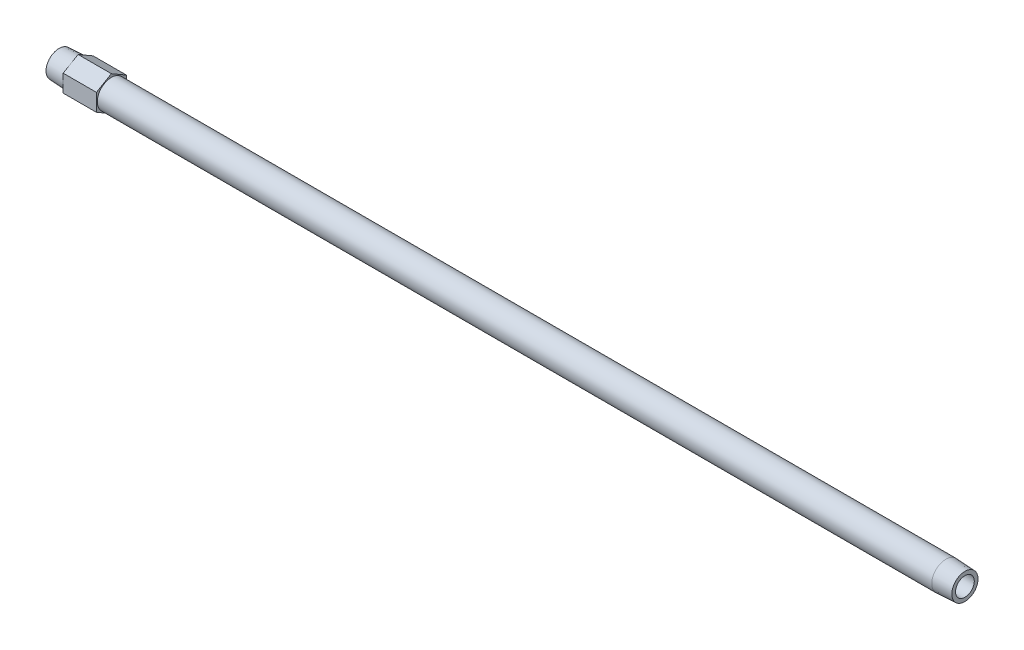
ISO-10303-21;
HEADER;
FILE_DESCRIPTION(('STEP AP214'),'2;1');
FILE_NAME('part.step','',(''),(''),'','','');
FILE_SCHEMA(('AUTOMOTIVE_DESIGN { 1 0 10303 214 1 1 1 1 }'));
ENDSEC;
DATA;
#1=APPLICATION_CONTEXT('core data for automotive mechanical design processes');
#2=APPLICATION_PROTOCOL_DEFINITION('international standard','automotive_design',2000,#1);
#3=PRODUCT_CONTEXT('',#1,'mechanical');
#4=PRODUCT('Part','Part','',(#3));
#5=PRODUCT_RELATED_PRODUCT_CATEGORY('part','',(#4));
#6=PRODUCT_DEFINITION_FORMATION('','',#4);
#7=PRODUCT_DEFINITION_CONTEXT('part definition',#1,'design');
#8=PRODUCT_DEFINITION('design','',#6,#7);
#9=PRODUCT_DEFINITION_SHAPE('','',#8);
#10=(LENGTH_UNIT() NAMED_UNIT(*) SI_UNIT(.MILLI.,.METRE.));
#11=(NAMED_UNIT(*) PLANE_ANGLE_UNIT() SI_UNIT($,.RADIAN.));
#12=(NAMED_UNIT(*) SI_UNIT($,.STERADIAN.) SOLID_ANGLE_UNIT());
#13=UNCERTAINTY_MEASURE_WITH_UNIT(LENGTH_MEASURE(1.E-05),#10,'distance_accuracy_value','');
#14=(GEOMETRIC_REPRESENTATION_CONTEXT(3) GLOBAL_UNCERTAINTY_ASSIGNED_CONTEXT((#13)) GLOBAL_UNIT_ASSIGNED_CONTEXT((#10,
#11,#12)) REPRESENTATION_CONTEXT('',''));
#15=CARTESIAN_POINT('',(0.,0.,0.));
#16=DIRECTION('',(0.,0.,1.));
#17=DIRECTION('',(1.,0.,0.));
#18=AXIS2_PLACEMENT_3D('',#15,#16,#17);
#19=CARTESIAN_POINT('',(0.,0.,-4.78009397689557));
#20=DIRECTION('',(1.,0.,0.));
#21=DIRECTION('',(0.,0.,-1.));
#22=AXIS2_PLACEMENT_3D('',#19,#20,#21);
#23=PLANE('',#22);
#24=CARTESIAN_POINT('',(0.,0.,0.));
#25=DIRECTION('',(-1.,0.,0.));
#26=DIRECTION('',(0.,0.,1.));
#27=AXIS2_PLACEMENT_3D('',#24,#25,#26);
#28=CIRCLE('',#27,4.78009397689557);
#29=CARTESIAN_POINT('',(0.,0.,4.78009397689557));
#30=VERTEX_POINT('',#29);
#31=EDGE_CURVE('E147',#30,#30,#28,.T.);
#32=ORIENTED_EDGE('',*,*,#31,.T.);
#33=EDGE_LOOP('',(#32));
#34=FACE_BOUND('',#33,.T.);
#35=CARTESIAN_POINT('',(0.,0.,0.));
#36=DIRECTION('',(1.,0.,0.));
#37=DIRECTION('',(0.,0.,1.));
#38=AXIS2_PLACEMENT_3D('',#35,#36,#37);
#39=CIRCLE('',#38,3.4163);
#40=CARTESIAN_POINT('',(0.,0.,3.4163));
#41=VERTEX_POINT('',#40);
#42=EDGE_CURVE('E159',#41,#41,#39,.T.);
#43=ORIENTED_EDGE('',*,*,#42,.T.);
#44=EDGE_LOOP('',(#43));
#45=FACE_BOUND('',#44,.T.);
#46=ADVANCED_FACE('F15',(#34,#45),#23,.F.);
#47=CARTESIAN_POINT('',(330.2,0.,-4.78009397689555));
#48=DIRECTION('',(-1.,0.,0.));
#49=DIRECTION('',(0.,0.,1.));
#50=AXIS2_PLACEMENT_3D('',#47,#48,#49);
#51=PLANE('',#50);
#52=CARTESIAN_POINT('',(330.2,0.,0.));
#53=DIRECTION('',(-1.,0.,0.));
#54=DIRECTION('',(0.,0.,1.));
#55=AXIS2_PLACEMENT_3D('',#52,#53,#54);
#56=CIRCLE('',#55,4.78009397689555);
#57=CARTESIAN_POINT('',(330.2,0.,4.78009397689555));
#58=VERTEX_POINT('',#57);
#59=EDGE_CURVE('E150',#58,#58,#56,.T.);
#60=ORIENTED_EDGE('',*,*,#59,.F.);
#61=EDGE_LOOP('',(#60));
#62=FACE_BOUND('',#61,.T.);
#63=CARTESIAN_POINT('',(330.2,0.,0.));
#64=DIRECTION('',(-1.,0.,0.));
#65=DIRECTION('',(0.,0.,1.));
#66=AXIS2_PLACEMENT_3D('',#63,#64,#65);
#67=CIRCLE('',#66,3.4163);
#68=CARTESIAN_POINT('',(330.2,0.,3.4163));
#69=VERTEX_POINT('',#68);
#70=EDGE_CURVE('E156',#69,#69,#67,.F.);
#71=ORIENTED_EDGE('',*,*,#70,.F.);
#72=EDGE_LOOP('',(#71));
#73=FACE_BOUND('',#72,.T.);
#74=ADVANCED_FACE('F178',(#62,#73),#51,.F.);
#75=CARTESIAN_POINT('',(19.05,-9.45872946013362,5.461));
#76=DIRECTION('',(-1.,0.,0.));
#77=DIRECTION('',(0.,-1.,0.));
#78=AXIS2_PLACEMENT_3D('',#75,#76,#77);
#79=PLANE('',#78);
#80=DIRECTION('',(0.,0.5,-0.866025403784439));
#81=VECTOR('',#80,1.);
#82=CARTESIAN_POINT('',(19.05,-6.30581964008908,0.));
#83=LINE('',#82,#81);
#84=CARTESIAN_POINT('',(19.05,-6.30581964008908,0.));
#85=VERTEX_POINT('',#84);
#86=CARTESIAN_POINT('',(19.05,-3.15290982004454,-5.461));
#87=VERTEX_POINT('',#86);
#88=EDGE_CURVE('E103',#85,#87,#83,.T.);
#89=ORIENTED_EDGE('',*,*,#88,.T.);
#90=DIRECTION('',(0.,1.,0.));
#91=VECTOR('',#90,1.);
#92=CARTESIAN_POINT('',(19.05,-3.15290982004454,-5.461));
#93=LINE('',#92,#91);
#94=CARTESIAN_POINT('',(19.05,3.15290982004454,-5.461));
#95=VERTEX_POINT('',#94);
#96=EDGE_CURVE('E83',#87,#95,#93,.T.);
#97=ORIENTED_EDGE('',*,*,#96,.T.);
#98=DIRECTION('',(0.,0.5,0.866025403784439));
#99=VECTOR('',#98,1.);
#100=CARTESIAN_POINT('',(19.05,3.15290982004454,-5.461));
#101=LINE('',#100,#99);
#102=CARTESIAN_POINT('',(19.05,6.30581964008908,0.));
#103=VERTEX_POINT('',#102);
#104=EDGE_CURVE('E102',#95,#103,#101,.T.);
#105=ORIENTED_EDGE('',*,*,#104,.T.);
#106=DIRECTION('',(0.,-0.5,0.866025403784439));
#107=VECTOR('',#106,1.);
#108=CARTESIAN_POINT('',(19.05,6.30581964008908,0.));
#109=LINE('',#108,#107);
#110=CARTESIAN_POINT('',(19.05,3.15290982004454,5.461));
#111=VERTEX_POINT('',#110);
#112=EDGE_CURVE('E105',#103,#111,#109,.T.);
#113=ORIENTED_EDGE('',*,*,#112,.T.);
#114=DIRECTION('',(0.,-1.,0.));
#115=VECTOR('',#114,1.);
#116=CARTESIAN_POINT('',(19.05,3.15290982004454,5.461));
#117=LINE('',#116,#115);
#118=CARTESIAN_POINT('',(19.05,-3.15290982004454,5.461));
#119=VERTEX_POINT('',#118);
#120=EDGE_CURVE('E35',#111,#119,#117,.T.);
#121=ORIENTED_EDGE('',*,*,#120,.T.);
#122=DIRECTION('',(0.,-0.5,-0.866025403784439));
#123=VECTOR('',#122,1.);
#124=CARTESIAN_POINT('',(19.05,-3.15290982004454,5.461));
#125=LINE('',#124,#123);
#126=EDGE_CURVE('E30',#119,#85,#125,.T.);
#127=ORIENTED_EDGE('',*,*,#126,.T.);
#128=EDGE_LOOP('',(#89,#97,#105,#113,#121,#127));
#129=FACE_BOUND('',#128,.T.);
#130=CARTESIAN_POINT('',(19.05,0.,0.));
#131=DIRECTION('',(-1.,0.,0.));
#132=DIRECTION('',(0.,-1.,0.));
#133=AXIS2_PLACEMENT_3D('',#130,#131,#132);
#134=CIRCLE('',#133,5.1435);
#135=CARTESIAN_POINT('',(19.05,-5.1435,0.));
#136=VERTEX_POINT('',#135);
#137=EDGE_CURVE('E89',#136,#136,#134,.F.);
#138=ORIENTED_EDGE('',*,*,#137,.F.);
#139=EDGE_LOOP('',(#138));
#140=FACE_BOUND('',#139,.T.);
#141=ADVANCED_FACE('F124',(#129,#140),#79,.F.);
#142=CARTESIAN_POINT('',(6.9342,-9.45872946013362,5.461));
#143=DIRECTION('',(-1.,0.,0.));
#144=DIRECTION('',(0.,-1.,0.));
#145=AXIS2_PLACEMENT_3D('',#142,#143,#144);
#146=PLANE('',#145);
#147=DIRECTION('',(0.,0.5,-0.866025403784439));
#148=VECTOR('',#147,1.);
#149=CARTESIAN_POINT('',(6.9342,-6.30581964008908,0.));
#150=LINE('',#149,#148);
#151=CARTESIAN_POINT('',(6.9342,-6.30581964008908,0.));
#152=VERTEX_POINT('',#151);
#153=CARTESIAN_POINT('',(6.9342,-3.15290982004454,-5.461));
#154=VERTEX_POINT('',#153);
#155=EDGE_CURVE('E73',#152,#154,#150,.T.);
#156=ORIENTED_EDGE('',*,*,#155,.F.);
#157=DIRECTION('',(0.,-0.5,-0.866025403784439));
#158=VECTOR('',#157,1.);
#159=CARTESIAN_POINT('',(6.9342,-3.15290982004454,5.461));
#160=LINE('',#159,#158);
#161=CARTESIAN_POINT('',(6.9342,-3.15290982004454,5.461));
#162=VERTEX_POINT('',#161);
#163=EDGE_CURVE('E99',#162,#152,#160,.T.);
#164=ORIENTED_EDGE('',*,*,#163,.F.);
#165=DIRECTION('',(0.,-1.,0.));
#166=VECTOR('',#165,1.);
#167=CARTESIAN_POINT('',(6.9342,3.15290982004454,5.461));
#168=LINE('',#167,#166);
#169=CARTESIAN_POINT('',(6.9342,3.15290982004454,5.461));
#170=VERTEX_POINT('',#169);
#171=EDGE_CURVE('E133',#170,#162,#168,.T.);
#172=ORIENTED_EDGE('',*,*,#171,.F.);
#173=DIRECTION('',(0.,-0.5,0.866025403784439));
#174=VECTOR('',#173,1.);
#175=CARTESIAN_POINT('',(6.9342,6.30581964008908,0.));
#176=LINE('',#175,#174);
#177=CARTESIAN_POINT('',(6.9342,6.30581964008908,0.));
#178=VERTEX_POINT('',#177);
#179=EDGE_CURVE('E129',#178,#170,#176,.T.);
#180=ORIENTED_EDGE('',*,*,#179,.F.);
#181=DIRECTION('',(0.,0.5,0.866025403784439));
#182=VECTOR('',#181,1.);
#183=CARTESIAN_POINT('',(6.9342,3.15290982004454,-5.461));
#184=LINE('',#183,#182);
#185=CARTESIAN_POINT('',(6.9342,3.15290982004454,-5.461));
#186=VERTEX_POINT('',#185);
#187=EDGE_CURVE('E75',#186,#178,#184,.T.);
#188=ORIENTED_EDGE('',*,*,#187,.F.);
#189=DIRECTION('',(0.,1.,0.));
#190=VECTOR('',#189,1.);
#191=CARTESIAN_POINT('',(6.9342,-3.15290982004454,-5.461));
#192=LINE('',#191,#190);
#193=EDGE_CURVE('E68',#154,#186,#192,.T.);
#194=ORIENTED_EDGE('',*,*,#193,.F.);
#195=EDGE_LOOP('',(#156,#164,#172,#180,#188,#194));
#196=FACE_BOUND('',#195,.T.);
#197=CARTESIAN_POINT('',(6.9342,0.,0.));
#198=DIRECTION('',(-1.,0.,0.));
#199=DIRECTION('',(0.,0.,1.));
#200=AXIS2_PLACEMENT_3D('',#197,#198,#199);
#201=CIRCLE('',#200,5.1435);
#202=CARTESIAN_POINT('',(6.9342,0.,5.1435));
#203=VERTEX_POINT('',#202);
#204=EDGE_CURVE('E95',#203,#203,#201,.T.);
#205=ORIENTED_EDGE('',*,*,#204,.F.);
#206=EDGE_LOOP('',(#205));
#207=FACE_BOUND('',#206,.T.);
#208=ADVANCED_FACE('F69',(#196,#207),#146,.T.);
#209=CARTESIAN_POINT('',(19.05,-6.30581964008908,0.));
#210=DIRECTION('',(0.,0.866025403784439,0.5));
#211=DIRECTION('',(0.,-0.5,0.866025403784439));
#212=AXIS2_PLACEMENT_3D('',#209,#210,#211);
#213=PLANE('',#212);
#214=ORIENTED_EDGE('',*,*,#155,.T.);
#215=DIRECTION('',(-1.,0.,0.));
#216=VECTOR('',#215,1.);
#217=CARTESIAN_POINT('',(19.05,-3.15290982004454,-5.461));
#218=LINE('',#217,#216);
#219=EDGE_CURVE('E10',#87,#154,#218,.T.);
#220=ORIENTED_EDGE('',*,*,#219,.F.);
#221=ORIENTED_EDGE('',*,*,#88,.F.);
#222=DIRECTION('',(-1.,0.,0.));
#223=VECTOR('',#222,1.);
#224=CARTESIAN_POINT('',(19.05,-6.30581964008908,0.));
#225=LINE('',#224,#223);
#226=EDGE_CURVE('E87',#85,#152,#225,.T.);
#227=ORIENTED_EDGE('',*,*,#226,.T.);
#228=EDGE_LOOP('',(#214,#220,#221,#227));
#229=FACE_BOUND('',#228,.T.);
#230=ADVANCED_FACE('F17',(#229),#213,.F.);
#231=CARTESIAN_POINT('',(19.05,-3.15290982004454,-5.461));
#232=DIRECTION('',(0.,0.,1.));
#233=DIRECTION('',(0.,-1.,0.));
#234=AXIS2_PLACEMENT_3D('',#231,#232,#233);
#235=PLANE('',#234);
#236=ORIENTED_EDGE('',*,*,#193,.T.);
#237=DIRECTION('',(-1.,0.,0.));
#238=VECTOR('',#237,1.);
#239=CARTESIAN_POINT('',(19.05,3.15290982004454,-5.461));
#240=LINE('',#239,#238);
#241=EDGE_CURVE('E23',#95,#186,#240,.T.);
#242=ORIENTED_EDGE('',*,*,#241,.F.);
#243=ORIENTED_EDGE('',*,*,#96,.F.);
#244=ORIENTED_EDGE('',*,*,#219,.T.);
#245=EDGE_LOOP('',(#236,#242,#243,#244));
#246=FACE_BOUND('',#245,.T.);
#247=ADVANCED_FACE('F82',(#246),#235,.F.);
#248=CARTESIAN_POINT('',(19.05,3.15290982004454,-5.461));
#249=DIRECTION('',(0.,-0.866025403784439,0.5));
#250=DIRECTION('',(0.,-0.5,-0.866025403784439));
#251=AXIS2_PLACEMENT_3D('',#248,#249,#250);
#252=PLANE('',#251);
#253=ORIENTED_EDGE('',*,*,#187,.T.);
#254=DIRECTION('',(-1.,0.,0.));
#255=VECTOR('',#254,1.);
#256=CARTESIAN_POINT('',(19.05,6.30581964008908,0.));
#257=LINE('',#256,#255);
#258=EDGE_CURVE('E117',#103,#178,#257,.T.);
#259=ORIENTED_EDGE('',*,*,#258,.F.);
#260=ORIENTED_EDGE('',*,*,#104,.F.);
#261=ORIENTED_EDGE('',*,*,#241,.T.);
#262=EDGE_LOOP('',(#253,#259,#260,#261));
#263=FACE_BOUND('',#262,.T.);
#264=ADVANCED_FACE('F121',(#263),#252,.F.);
#265=CARTESIAN_POINT('',(19.05,6.30581964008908,0.));
#266=DIRECTION('',(0.,-0.866025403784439,-0.5));
#267=DIRECTION('',(0.,0.5,-0.866025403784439));
#268=AXIS2_PLACEMENT_3D('',#265,#266,#267);
#269=PLANE('',#268);
#270=ORIENTED_EDGE('',*,*,#179,.T.);
#271=DIRECTION('',(-1.,0.,0.));
#272=VECTOR('',#271,1.);
#273=CARTESIAN_POINT('',(19.05,3.15290982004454,5.461));
#274=LINE('',#273,#272);
#275=EDGE_CURVE('E114',#111,#170,#274,.T.);
#276=ORIENTED_EDGE('',*,*,#275,.F.);
#277=ORIENTED_EDGE('',*,*,#112,.F.);
#278=ORIENTED_EDGE('',*,*,#258,.T.);
#279=EDGE_LOOP('',(#270,#276,#277,#278));
#280=FACE_BOUND('',#279,.T.);
#281=ADVANCED_FACE('F128',(#280),#269,.F.);
#282=CARTESIAN_POINT('',(19.05,3.15290982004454,5.461));
#283=DIRECTION('',(0.,0.,-1.));
#284=DIRECTION('',(-1.,0.,0.));
#285=AXIS2_PLACEMENT_3D('',#282,#283,#284);
#286=PLANE('',#285);
#287=ORIENTED_EDGE('',*,*,#171,.T.);
#288=DIRECTION('',(-1.,0.,0.));
#289=VECTOR('',#288,1.);
#290=CARTESIAN_POINT('',(19.05,-3.15290982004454,5.461));
#291=LINE('',#290,#289);
#292=EDGE_CURVE('E111',#119,#162,#291,.T.);
#293=ORIENTED_EDGE('',*,*,#292,.F.);
#294=ORIENTED_EDGE('',*,*,#120,.F.);
#295=ORIENTED_EDGE('',*,*,#275,.T.);
#296=EDGE_LOOP('',(#287,#293,#294,#295));
#297=FACE_BOUND('',#296,.T.);
#298=ADVANCED_FACE('F132',(#297),#286,.F.);
#299=CARTESIAN_POINT('',(19.05,-3.15290982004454,5.461));
#300=DIRECTION('',(0.,0.866025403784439,-0.5));
#301=DIRECTION('',(0.,0.5,0.866025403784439));
#302=AXIS2_PLACEMENT_3D('',#299,#300,#301);
#303=PLANE('',#302);
#304=ORIENTED_EDGE('',*,*,#163,.T.);
#305=ORIENTED_EDGE('',*,*,#226,.F.);
#306=ORIENTED_EDGE('',*,*,#126,.F.);
#307=ORIENTED_EDGE('',*,*,#292,.T.);
#308=EDGE_LOOP('',(#304,#305,#306,#307));
#309=FACE_BOUND('',#308,.T.);
#310=ADVANCED_FACE('F135',(#309),#303,.F.);
#311=CARTESIAN_POINT('',(6.9342,0.,0.));
#312=DIRECTION('',(1.,0.,0.));
#313=DIRECTION('',(0.,0.,-1.));
#314=AXIS2_PLACEMENT_3D('',#311,#312,#313);
#315=CONICAL_SURFACE('',#314,5.1435,0.0523598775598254);
#316=ORIENTED_EDGE('',*,*,#31,.F.);
#317=EDGE_LOOP('',(#316));
#318=FACE_BOUND('',#317,.T.);
#319=ORIENTED_EDGE('',*,*,#204,.T.);
#320=EDGE_LOOP('',(#319));
#321=FACE_BOUND('',#320,.T.);
#322=ADVANCED_FACE('F187',(#318,#321),#315,.T.);
#323=CARTESIAN_POINT('',(-60.,0.,0.));
#324=DIRECTION('',(-1.,0.,0.));
#325=DIRECTION('',(0.,0.,1.));
#326=AXIS2_PLACEMENT_3D('',#323,#324,#325);
#327=CYLINDRICAL_SURFACE('',#326,5.1435);
#328=ORIENTED_EDGE('',*,*,#137,.T.);
#329=EDGE_LOOP('',(#328));
#330=FACE_BOUND('',#329,.T.);
#331=CARTESIAN_POINT('',(323.2658,0.,0.));
#332=DIRECTION('',(-1.,0.,0.));
#333=DIRECTION('',(0.,0.,1.));
#334=AXIS2_PLACEMENT_3D('',#331,#332,#333);
#335=CIRCLE('',#334,5.1435);
#336=CARTESIAN_POINT('',(323.2658,0.,5.1435));
#337=VERTEX_POINT('',#336);
#338=EDGE_CURVE('E153',#337,#337,#335,.T.);
#339=ORIENTED_EDGE('',*,*,#338,.T.);
#340=EDGE_LOOP('',(#339));
#341=FACE_BOUND('',#340,.T.);
#342=ADVANCED_FACE('F174',(#330,#341),#327,.T.);
#343=CARTESIAN_POINT('',(330.2,0.,0.));
#344=DIRECTION('',(-1.,0.,0.));
#345=DIRECTION('',(0.,0.,1.));
#346=AXIS2_PLACEMENT_3D('',#343,#344,#345);
#347=CONICAL_SURFACE('',#346,4.78009397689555,0.0523598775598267);
#348=ORIENTED_EDGE('',*,*,#338,.F.);
#349=EDGE_LOOP('',(#348));
#350=FACE_BOUND('',#349,.T.);
#351=ORIENTED_EDGE('',*,*,#59,.T.);
#352=EDGE_LOOP('',(#351));
#353=FACE_BOUND('',#352,.T.);
#354=ADVANCED_FACE('F167',(#350,#353),#347,.T.);
#355=CARTESIAN_POINT('',(330.621208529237,0.,0.));
#356=DIRECTION('',(-1.,0.,0.));
#357=DIRECTION('',(0.,0.,1.));
#358=AXIS2_PLACEMENT_3D('',#355,#356,#357);
#359=CYLINDRICAL_SURFACE('',#358,3.4163);
#360=ORIENTED_EDGE('',*,*,#70,.T.);
#361=EDGE_LOOP('',(#360));
#362=FACE_BOUND('',#361,.T.);
#363=ORIENTED_EDGE('',*,*,#42,.F.);
#364=EDGE_LOOP('',(#363));
#365=FACE_BOUND('',#364,.T.);
#366=ADVANCED_FACE('F165',(#362,#365),#359,.F.);
#367=CLOSED_SHELL('',(#46,#74,#141,#208,#230,#247,#264,#281,#298,#310,#322,#342,#354,#366));
#368=MANIFOLD_SOLID_BREP('B1',#367);
#369=ADVANCED_BREP_SHAPE_REPRESENTATION('',(#18,#368),#14);
#370=SHAPE_DEFINITION_REPRESENTATION(#9,#369);
ENDSEC;
END-ISO-10303-21;
